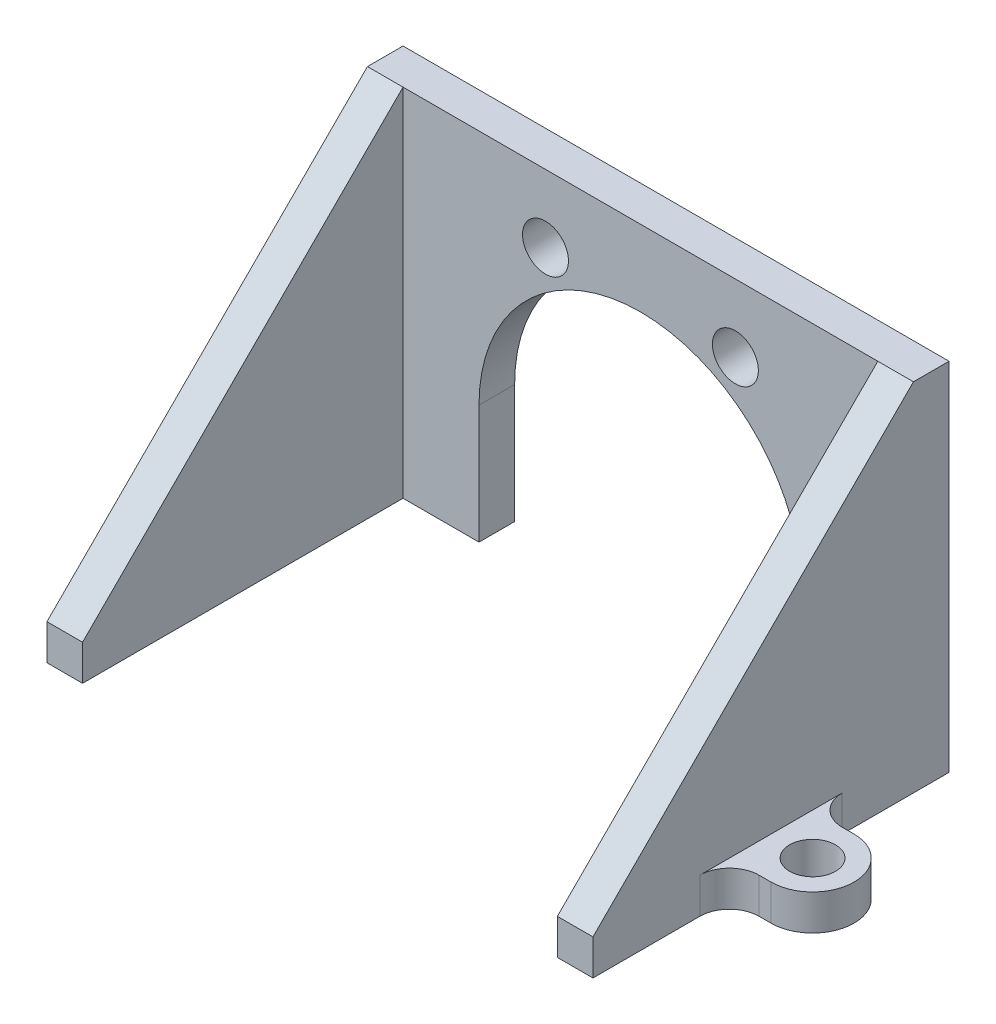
from build123d import *

# Parameters (mm, degrees)
BOSS_EXTRUDE1_DEPTH          = 29.21
SKETCH2_W                    = 50.8
SKETCH2_H                    = 38.1
CUT_EXTRUDE1_DEPTH           = 34.29
BOSS_EXTRUDE2_DEPTH          = 3.81
FILLET1_R                    = 3.175
F_10_0_1935_DIAMETER_HOLE1_D = 4.9149
CUT_EXTRUDE2_DEPTH           = 66.991135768
F_10_0_1935_DIAMETER_HOLE2_D = 4.9149


with BuildPart() as part:
    # Sketch1 → Boss-Extrude1 (new, symmetric)
    with BuildSketch(Plane(origin=(0, 0, 0), x_dir=(0, 0, -1), z_dir=(1, 0, 0))):
        Polygon((0, 0), (0, 38.1), (-3.81, 38.1), (-38.1, 3.81), (-38.1, 0), align=None)
    extrude(amount=BOSS_EXTRUDE1_DEPTH, both=True)

    # Sketch2 → Cut-Extrude1 (cut)
    with BuildSketch(Plane(origin=(0, 0, 38.1), x_dir=(1, 0, 0), z_dir=(0, 0, -1))):
        with Locations((0, -19.05)):
            Rectangle(SKETCH2_W, SKETCH2_H)
    extrude(amount=CUT_EXTRUDE1_DEPTH, mode=Mode.SUBTRACT)

    # Sketch3 → Boss-Extrude2 (add)
    with BuildSketch(Plane.XZ):
        with BuildLine():
            Line((-33.655, 23.495), (-29.21, 23.495))
            Line((-29.21, 23.495), (-29.21, 14.605))
            Line((-29.21, 14.605), (-33.655, 14.605))
            ThreePointArc((-33.655, 14.605), (-38.1, 19.05), (-33.655, 23.495))
        make_face()
        with BuildLine():
            Line((29.21, 14.605), (29.21, 23.495))
            Line((29.21, 23.495), (33.655, 23.495))
            ThreePointArc((33.655, 23.495), (38.1, 19.05), (33.655, 14.605))
            Line((33.655, 14.605), (29.21, 14.605))
        make_face()
    extrude(amount=-BOSS_EXTRUDE2_DEPTH)

    # Fillet1
    fillet1_edges = [part.edges().sort_by_distance(p)[0] for p in [
        (-29.21, 1.905, 14.605),
        (29.21, 1.905, 14.605),
        (29.21, 1.905, 23.495),
        (-29.21, 1.905, 23.495),
    ]]
    fillet(fillet1_edges, radius=FILLET1_R)

    # 10 _0.1935_ Diameter Hole1 (through all)
    with Locations(Plane(origin=(0, 3.81, 0), x_dir=(1, 0, 0), z_dir=(0, 1, 0))):
        with Locations((-33.655, -19.05), (33.655, -19.05)):
            Hole(F_10_0_1935_DIAMETER_HOLE1_D / 2)

    # Sketch6 → Cut-Extrude2 (cut, through all)
    with BuildSketch(Plane(origin=(0, 0, 0), x_dir=(-1, 0, 0), z_dir=(0, 0, -1))):
        with BuildLine():
            Line((17.272, 12.7), (17.272, 0))
            Line((17.272, 0), (-17.272, 0))
            Line((-17.272, 0), (-17.272, 12.7))
            ThreePointArc((-17.272, 12.7), (0, 29.972), (17.272, 12.7))
        make_face()
    extrude(amount=-CUT_EXTRUDE2_DEPTH, mode=Mode.SUBTRACT)

    # 10 _0.1935_ Diameter Hole2 (through all)
    with Locations(Plane(origin=(0, 0, 0), x_dir=(-1, 0, 0), z_dir=(0, 0, -1))):
        with Locations((-10.16, 30.845355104), (10.16, 30.845355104)):
            Hole(F_10_0_1935_DIAMETER_HOLE2_D / 2)


solid = part.part
